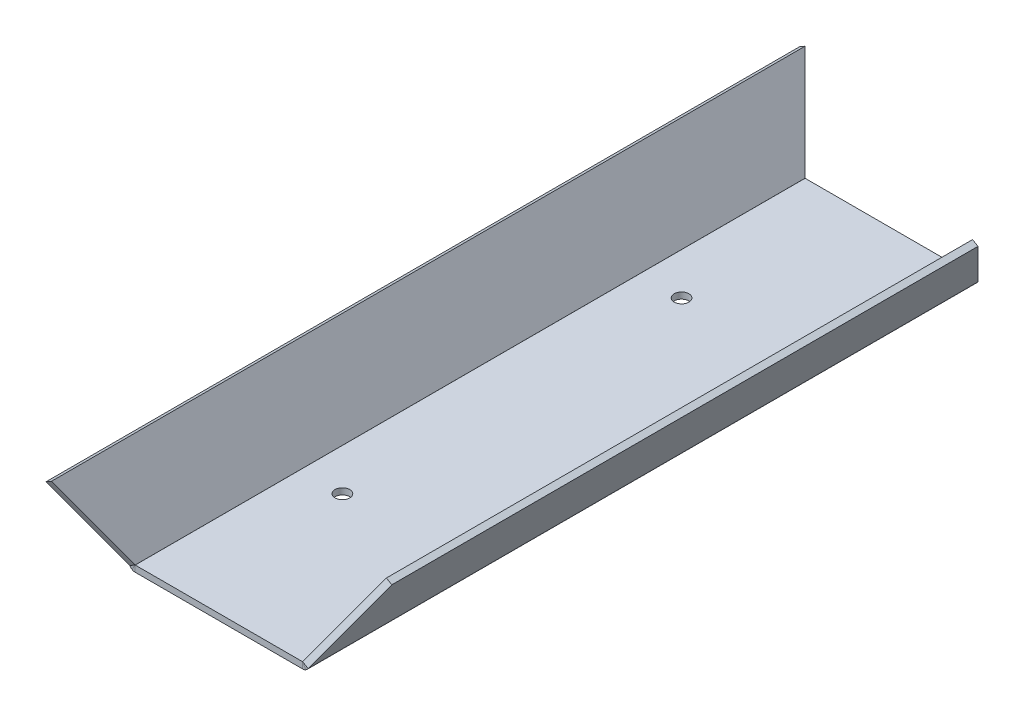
ISO-10303-21;
HEADER;
FILE_DESCRIPTION(('STEP AP214'),'2;1');
FILE_NAME('part.step','',(''),(''),'','','');
FILE_SCHEMA(('AUTOMOTIVE_DESIGN { 1 0 10303 214 1 1 1 1 }'));
ENDSEC;
DATA;
#1=APPLICATION_CONTEXT('core data for automotive mechanical design processes');
#2=APPLICATION_PROTOCOL_DEFINITION('international standard','automotive_design',2000,#1);
#3=PRODUCT_CONTEXT('',#1,'mechanical');
#4=PRODUCT('Part','Part','',(#3));
#5=PRODUCT_RELATED_PRODUCT_CATEGORY('part','',(#4));
#6=PRODUCT_DEFINITION_FORMATION('','',#4);
#7=PRODUCT_DEFINITION_CONTEXT('part definition',#1,'design');
#8=PRODUCT_DEFINITION('design','',#6,#7);
#9=PRODUCT_DEFINITION_SHAPE('','',#8);
#10=(LENGTH_UNIT() NAMED_UNIT(*) SI_UNIT(.MILLI.,.METRE.));
#11=(NAMED_UNIT(*) PLANE_ANGLE_UNIT() SI_UNIT($,.RADIAN.));
#12=(NAMED_UNIT(*) SI_UNIT($,.STERADIAN.) SOLID_ANGLE_UNIT());
#13=UNCERTAINTY_MEASURE_WITH_UNIT(LENGTH_MEASURE(1.E-05),#10,'distance_accuracy_value','');
#14=(GEOMETRIC_REPRESENTATION_CONTEXT(3) GLOBAL_UNCERTAINTY_ASSIGNED_CONTEXT((#13)) GLOBAL_UNIT_ASSIGNED_CONTEXT((#10,
#11,#12)) REPRESENTATION_CONTEXT('',''));
#15=CARTESIAN_POINT('',(0.,0.,0.));
#16=DIRECTION('',(0.,0.,1.));
#17=DIRECTION('',(1.,0.,0.));
#18=AXIS2_PLACEMENT_3D('',#15,#16,#17);
#19=CARTESIAN_POINT('',(20.,1.5,80.));
#20=DIRECTION('',(0.,0.,-1.));
#21=DIRECTION('',(-1.,0.,0.));
#22=AXIS2_PLACEMENT_3D('',#19,#20,#21);
#23=PLANE('',#22);
#24=DIRECTION('',(1.,0.,0.));
#25=VECTOR('',#24,1.);
#26=CARTESIAN_POINT('',(20.,1.5,80.));
#27=LINE('',#26,#25);
#28=CARTESIAN_POINT('',(20.0052438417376,1.5,80.));
#29=VERTEX_POINT('',#28);
#30=CARTESIAN_POINT('',(59.9947561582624,1.5,80.));
#31=VERTEX_POINT('',#30);
#32=EDGE_CURVE('E586',#29,#31,#27,.T.);
#33=ORIENTED_EDGE('',*,*,#32,.F.);
#34=DIRECTION('',(0.,-1.,0.));
#35=VECTOR('',#34,1.);
#36=CARTESIAN_POINT('',(20.0052438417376,1.5,80.));
#37=LINE('',#36,#35);
#38=CARTESIAN_POINT('',(20.0052438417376,0.,80.));
#39=VERTEX_POINT('',#38);
#40=EDGE_CURVE('E12',#29,#39,#37,.T.);
#41=ORIENTED_EDGE('',*,*,#40,.T.);
#42=DIRECTION('',(1.,0.,0.));
#43=VECTOR('',#42,1.);
#44=CARTESIAN_POINT('',(20.,0.,80.));
#45=LINE('',#44,#43);
#46=CARTESIAN_POINT('',(59.9947561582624,0.,80.));
#47=VERTEX_POINT('',#46);
#48=EDGE_CURVE('E481',#39,#47,#45,.T.);
#49=ORIENTED_EDGE('',*,*,#48,.T.);
#50=DIRECTION('',(0.,-1.,0.));
#51=VECTOR('',#50,1.);
#52=CARTESIAN_POINT('',(59.9947561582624,1.5,80.));
#53=LINE('',#52,#51);
#54=EDGE_CURVE('E499',#31,#47,#53,.T.);
#55=ORIENTED_EDGE('',*,*,#54,.F.);
#56=EDGE_LOOP('',(#33,#41,#49,#55));
#57=FACE_BOUND('',#56,.T.);
#58=ADVANCED_FACE('F66',(#57),#23,.F.);
#59=CARTESIAN_POINT('',(20.,1.5,-80.));
#60=DIRECTION('',(0.,0.,1.));
#61=DIRECTION('',(1.,0.,0.));
#62=AXIS2_PLACEMENT_3D('',#59,#60,#61);
#63=PLANE('',#62);
#64=DIRECTION('',(-1.,0.,0.));
#65=VECTOR('',#64,1.);
#66=CARTESIAN_POINT('',(20.,0.,-80.));
#67=LINE('',#66,#65);
#68=CARTESIAN_POINT('',(59.9947561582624,0.,-80.));
#69=VERTEX_POINT('',#68);
#70=CARTESIAN_POINT('',(20.0052438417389,0.,-80.));
#71=VERTEX_POINT('',#70);
#72=EDGE_CURVE('E488',#69,#71,#67,.T.);
#73=ORIENTED_EDGE('',*,*,#72,.T.);
#74=DIRECTION('',(0.,1.,0.));
#75=VECTOR('',#74,1.);
#76=CARTESIAN_POINT('',(20.0052438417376,1.5,-80.));
#77=LINE('',#76,#75);
#78=CARTESIAN_POINT('',(20.0052438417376,1.5,-80.));
#79=VERTEX_POINT('',#78);
#80=EDGE_CURVE('E578',#71,#79,#77,.T.);
#81=ORIENTED_EDGE('',*,*,#80,.T.);
#82=DIRECTION('',(-1.,0.,0.));
#83=VECTOR('',#82,1.);
#84=CARTESIAN_POINT('',(20.,1.5,-80.));
#85=LINE('',#84,#83);
#86=CARTESIAN_POINT('',(59.9947561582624,1.5,-80.));
#87=VERTEX_POINT('',#86);
#88=EDGE_CURVE('E492',#87,#79,#85,.T.);
#89=ORIENTED_EDGE('',*,*,#88,.F.);
#90=DIRECTION('',(0.,1.,0.));
#91=VECTOR('',#90,1.);
#92=CARTESIAN_POINT('',(59.9947561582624,1.5,-80.));
#93=LINE('',#92,#91);
#94=EDGE_CURVE('E496',#69,#87,#93,.T.);
#95=ORIENTED_EDGE('',*,*,#94,.F.);
#96=EDGE_LOOP('',(#73,#81,#89,#95));
#97=FACE_BOUND('',#96,.T.);
#98=ADVANCED_FACE('F561',(#97),#63,.F.);
#99=CARTESIAN_POINT('',(80.,1.5,-50.));
#100=DIRECTION('',(0.,-1.,0.));
#101=DIRECTION('',(0.,0.,-1.));
#102=AXIS2_PLACEMENT_3D('',#99,#100,#101);
#103=PLANE('',#102);
#104=CARTESIAN_POINT('',(30.,1.5,40.5));
#105=DIRECTION('',(0.,1.,0.));
#106=DIRECTION('',(0.,0.,-1.));
#107=AXIS2_PLACEMENT_3D('',#104,#105,#106);
#108=CIRCLE('',#107,1.75);
#109=CARTESIAN_POINT('',(30.,1.5,38.75));
#110=VERTEX_POINT('',#109);
#111=EDGE_CURVE('E493',#110,#110,#108,.T.);
#112=ORIENTED_EDGE('',*,*,#111,.F.);
#113=EDGE_LOOP('',(#112));
#114=FACE_BOUND('',#113,.T.);
#115=CARTESIAN_POINT('',(30.,1.5,-40.5));
#116=DIRECTION('',(0.,1.,0.));
#117=DIRECTION('',(0.,0.,1.));
#118=AXIS2_PLACEMENT_3D('',#115,#116,#117);
#119=CIRCLE('',#118,1.75);
#120=CARTESIAN_POINT('',(30.,1.5,-38.75));
#121=VERTEX_POINT('',#120);
#122=EDGE_CURVE('E489',#121,#121,#119,.T.);
#123=ORIENTED_EDGE('',*,*,#122,.F.);
#124=EDGE_LOOP('',(#123));
#125=FACE_BOUND('',#124,.T.);
#126=ORIENTED_EDGE('',*,*,#88,.T.);
#127=DIRECTION('',(0.,0.,1.));
#128=VECTOR('',#127,1.);
#129=CARTESIAN_POINT('',(20.0052438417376,1.5,-50.));
#130=LINE('',#129,#128);
#131=EDGE_CURVE('E570',#79,#29,#130,.T.);
#132=ORIENTED_EDGE('',*,*,#131,.T.);
#133=ORIENTED_EDGE('',*,*,#32,.T.);
#134=DIRECTION('',(0.,0.,1.));
#135=VECTOR('',#134,1.);
#136=CARTESIAN_POINT('',(59.9947561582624,1.5,-50.));
#137=LINE('',#136,#135);
#138=EDGE_CURVE('E502',#87,#31,#137,.T.);
#139=ORIENTED_EDGE('',*,*,#138,.F.);
#140=EDGE_LOOP('',(#126,#132,#133,#139));
#141=FACE_BOUND('',#140,.T.);
#142=ADVANCED_FACE('F549',(#114,#125,#141),#103,.F.);
#143=CARTESIAN_POINT('',(60.0007944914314,1.5004586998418,-80.));
#144=DIRECTION('',(-0.223606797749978,-0.387298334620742,0.894427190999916));
#145=DIRECTION('',(0.447213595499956,0.774596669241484,0.447213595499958));
#146=AXIS2_PLACEMENT_3D('',#143,#144,#145);
#147=PLANE('',#146);
#148=DIRECTION('',(-0.447213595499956,-0.774596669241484,-0.447213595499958));
#149=VECTOR('',#148,1.);
#150=CARTESIAN_POINT('',(61.2998325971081,0.750458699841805,-80.));
#151=LINE('',#150,#149);
#152=CARTESIAN_POINT('',(71.2998325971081,18.0709667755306,-70.));
#153=VERTEX_POINT('',#152);
#154=CARTESIAN_POINT('',(61.302454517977,0.75500000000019,-79.9973780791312));
#155=VERTEX_POINT('',#154);
#156=EDGE_CURVE('E511',#153,#155,#151,.T.);
#157=ORIENTED_EDGE('',*,*,#156,.T.);
#158=CARTESIAN_POINT('',(60.0034164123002,1.50499999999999,-79.9973780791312));
#159=CARTESIAN_POINT('',(61.3024545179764,0.754999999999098,-79.9973780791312));
#160=B_SPLINE_CURVE_WITH_KNOTS('',1,(#158,#159),.UNSPECIFIED.,.F.,.F.,(2,2),(0.,1.),.UNSPECIFIED.);
#161=CARTESIAN_POINT('',(60.0034164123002,1.505,-79.9973780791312));
#162=VERTEX_POINT('',#161);
#163=EDGE_CURVE('E469',#155,#162,#160,.F.);
#164=ORIENTED_EDGE('',*,*,#163,.T.);
#165=DIRECTION('',(-0.447213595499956,-0.774596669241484,-0.447213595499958));
#166=VECTOR('',#165,1.);
#167=CARTESIAN_POINT('',(60.0007944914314,1.5004586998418,-80.));
#168=LINE('',#167,#166);
#169=CARTESIAN_POINT('',(70.0007944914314,18.8209667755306,-70.));
#170=VERTEX_POINT('',#169);
#171=EDGE_CURVE('E507',#170,#162,#168,.T.);
#172=ORIENTED_EDGE('',*,*,#171,.F.);
#173=DIRECTION('',(0.86602540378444,-0.499999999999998,0.));
#174=VECTOR('',#173,1.);
#175=CARTESIAN_POINT('',(70.0007944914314,18.8209667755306,-70.));
#176=LINE('',#175,#174);
#177=EDGE_CURVE('E513',#170,#153,#176,.T.);
#178=ORIENTED_EDGE('',*,*,#177,.T.);
#179=EDGE_LOOP('',(#157,#164,#172,#178));
#180=FACE_BOUND('',#179,.T.);
#181=ADVANCED_FACE('F538',(#180),#147,.F.);
#182=CARTESIAN_POINT('',(60.0007944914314,1.50045869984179,80.));
#183=DIRECTION('',(-0.223606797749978,-0.387298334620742,-0.894427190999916));
#184=DIRECTION('',(-0.447213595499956,-0.774596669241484,0.447213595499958));
#185=AXIS2_PLACEMENT_3D('',#182,#183,#184);
#186=PLANE('',#185);
#187=DIRECTION('',(0.447213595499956,0.774596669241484,-0.447213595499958));
#188=VECTOR('',#187,1.);
#189=CARTESIAN_POINT('',(60.0007944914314,1.50045869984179,80.));
#190=LINE('',#189,#188);
#191=CARTESIAN_POINT('',(60.0034164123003,1.50500000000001,79.9973780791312));
#192=VERTEX_POINT('',#191);
#193=CARTESIAN_POINT('',(70.0007944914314,18.8209667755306,70.));
#194=VERTEX_POINT('',#193);
#195=EDGE_CURVE('E508',#192,#194,#190,.T.);
#196=ORIENTED_EDGE('',*,*,#195,.F.);
#197=CARTESIAN_POINT('',(61.3024545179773,0.755000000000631,79.9973780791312));
#198=CARTESIAN_POINT('',(60.0034164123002,1.505,79.9973780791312));
#199=B_SPLINE_CURVE_WITH_KNOTS('',1,(#197,#198),.UNSPECIFIED.,.F.,.F.,(2,2),(0.,1.),.UNSPECIFIED.);
#200=CARTESIAN_POINT('',(61.3024545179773,0.755000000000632,79.9973780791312));
#201=VERTEX_POINT('',#200);
#202=EDGE_CURVE('E579',#192,#201,#199,.F.);
#203=ORIENTED_EDGE('',*,*,#202,.T.);
#204=DIRECTION('',(0.447213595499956,0.774596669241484,-0.447213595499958));
#205=VECTOR('',#204,1.);
#206=CARTESIAN_POINT('',(61.2998325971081,0.750458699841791,80.));
#207=LINE('',#206,#205);
#208=CARTESIAN_POINT('',(71.2998325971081,18.0709667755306,70.));
#209=VERTEX_POINT('',#208);
#210=EDGE_CURVE('E512',#201,#209,#207,.T.);
#211=ORIENTED_EDGE('',*,*,#210,.T.);
#212=DIRECTION('',(0.86602540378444,-0.499999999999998,0.));
#213=VECTOR('',#212,1.);
#214=CARTESIAN_POINT('',(70.0007944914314,18.8209667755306,70.));
#215=LINE('',#214,#213);
#216=EDGE_CURVE('E516',#194,#209,#215,.T.);
#217=ORIENTED_EDGE('',*,*,#216,.F.);
#218=EDGE_LOOP('',(#196,#203,#211,#217));
#219=FACE_BOUND('',#218,.T.);
#220=ADVANCED_FACE('F548',(#219),#186,.F.);
#221=CARTESIAN_POINT('',(70.0007944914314,18.8209667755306,-50.));
#222=DIRECTION('',(0.86602540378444,-0.499999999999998,0.));
#223=DIRECTION('',(0.,0.,-1.));
#224=AXIS2_PLACEMENT_3D('',#221,#222,#223);
#225=PLANE('',#224);
#226=ORIENTED_EDGE('',*,*,#171,.T.);
#227=DIRECTION('',(0.,0.,1.));
#228=VECTOR('',#227,1.);
#229=CARTESIAN_POINT('',(60.0034164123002,1.50500000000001,-50.));
#230=LINE('',#229,#228);
#231=EDGE_CURVE('E519',#162,#192,#230,.T.);
#232=ORIENTED_EDGE('',*,*,#231,.T.);
#233=ORIENTED_EDGE('',*,*,#195,.T.);
#234=DIRECTION('',(0.,0.,-1.));
#235=VECTOR('',#234,1.);
#236=CARTESIAN_POINT('',(70.0007944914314,18.8209667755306,-70.));
#237=LINE('',#236,#235);
#238=EDGE_CURVE('E505',#194,#170,#237,.T.);
#239=ORIENTED_EDGE('',*,*,#238,.T.);
#240=EDGE_LOOP('',(#226,#232,#233,#239));
#241=FACE_BOUND('',#240,.T.);
#242=ADVANCED_FACE('F550',(#241),#225,.F.);
#243=CARTESIAN_POINT('',(71.2998325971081,18.0709667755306,-50.));
#244=DIRECTION('',(0.86602540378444,-0.499999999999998,0.));
#245=DIRECTION('',(0.,0.,-1.));
#246=AXIS2_PLACEMENT_3D('',#243,#244,#245);
#247=PLANE('',#246);
#248=DIRECTION('',(0.,0.,1.));
#249=VECTOR('',#248,1.);
#250=CARTESIAN_POINT('',(61.3024545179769,0.755000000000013,-50.));
#251=LINE('',#250,#249);
#252=EDGE_CURVE('E730',#155,#201,#251,.T.);
#253=ORIENTED_EDGE('',*,*,#252,.F.);
#254=ORIENTED_EDGE('',*,*,#156,.F.);
#255=DIRECTION('',(0.,0.,-1.));
#256=VECTOR('',#255,1.);
#257=CARTESIAN_POINT('',(71.2998325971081,18.0709667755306,-70.));
#258=LINE('',#257,#256);
#259=EDGE_CURVE('E509',#209,#153,#258,.T.);
#260=ORIENTED_EDGE('',*,*,#259,.F.);
#261=ORIENTED_EDGE('',*,*,#210,.F.);
#262=EDGE_LOOP('',(#253,#254,#260,#261));
#263=FACE_BOUND('',#262,.T.);
#264=ADVANCED_FACE('F552',(#263),#247,.T.);
#265=CARTESIAN_POINT('',(70.0007944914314,18.8209667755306,-70.));
#266=DIRECTION('',(-0.499999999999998,-0.86602540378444,0.));
#267=DIRECTION('',(0.,0.,1.));
#268=AXIS2_PLACEMENT_3D('',#265,#266,#267);
#269=PLANE('',#268);
#270=ORIENTED_EDGE('',*,*,#259,.T.);
#271=ORIENTED_EDGE('',*,*,#177,.F.);
#272=ORIENTED_EDGE('',*,*,#238,.F.);
#273=ORIENTED_EDGE('',*,*,#216,.T.);
#274=EDGE_LOOP('',(#270,#271,#272,#273));
#275=FACE_BOUND('',#274,.T.);
#276=ADVANCED_FACE('F555',(#275),#269,.F.);
#277=CARTESIAN_POINT('',(30.,1.5,40.5));
#278=DIRECTION('',(0.,-1.,0.));
#279=DIRECTION('',(0.,0.,-1.));
#280=AXIS2_PLACEMENT_3D('',#277,#278,#279);
#281=CYLINDRICAL_SURFACE('',#280,1.75);
#282=ORIENTED_EDGE('',*,*,#111,.T.);
#283=EDGE_LOOP('',(#282));
#284=FACE_BOUND('',#283,.T.);
#285=CARTESIAN_POINT('',(30.,0.,40.5));
#286=DIRECTION('',(0.,1.,0.));
#287=DIRECTION('',(0.,0.,-1.));
#288=AXIS2_PLACEMENT_3D('',#285,#286,#287);
#289=CIRCLE('',#288,1.75);
#290=CARTESIAN_POINT('',(30.,0.,38.75));
#291=VERTEX_POINT('',#290);
#292=EDGE_CURVE('E482',#291,#291,#289,.T.);
#293=ORIENTED_EDGE('',*,*,#292,.F.);
#294=EDGE_LOOP('',(#293));
#295=FACE_BOUND('',#294,.T.);
#296=ADVANCED_FACE('F430',(#284,#295),#281,.F.);
#297=CARTESIAN_POINT('',(30.,1.5,-40.5));
#298=DIRECTION('',(0.,-1.,0.));
#299=DIRECTION('',(0.,0.,-1.));
#300=AXIS2_PLACEMENT_3D('',#297,#298,#299);
#301=CYLINDRICAL_SURFACE('',#300,1.75);
#302=ORIENTED_EDGE('',*,*,#122,.T.);
#303=EDGE_LOOP('',(#302));
#304=FACE_BOUND('',#303,.T.);
#305=CARTESIAN_POINT('',(30.,0.,-40.5));
#306=DIRECTION('',(0.,1.,0.));
#307=DIRECTION('',(0.,0.,1.));
#308=AXIS2_PLACEMENT_3D('',#305,#306,#307);
#309=CIRCLE('',#308,1.75);
#310=CARTESIAN_POINT('',(30.,0.,-38.75));
#311=VERTEX_POINT('',#310);
#312=EDGE_CURVE('E485',#311,#311,#309,.T.);
#313=ORIENTED_EDGE('',*,*,#312,.F.);
#314=EDGE_LOOP('',(#313));
#315=FACE_BOUND('',#314,.T.);
#316=ADVANCED_FACE('F761',(#304,#315),#301,.F.);
#317=CARTESIAN_POINT('',(80.,0.,-50.));
#318=DIRECTION('',(0.,-1.,0.));
#319=DIRECTION('',(0.,0.,-1.));
#320=AXIS2_PLACEMENT_3D('',#317,#318,#319);
#321=PLANE('',#320);
#322=DIRECTION('',(0.,0.,1.));
#323=VECTOR('',#322,1.);
#324=CARTESIAN_POINT('',(20.0052438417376,0.,-50.));
#325=LINE('',#324,#323);
#326=EDGE_CURVE('E77',#71,#39,#325,.T.);
#327=ORIENTED_EDGE('',*,*,#326,.F.);
#328=ORIENTED_EDGE('',*,*,#72,.F.);
#329=DIRECTION('',(0.,0.,1.));
#330=VECTOR('',#329,1.);
#331=CARTESIAN_POINT('',(59.9947561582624,0.,-50.));
#332=LINE('',#331,#330);
#333=EDGE_CURVE('E473',#69,#47,#332,.T.);
#334=ORIENTED_EDGE('',*,*,#333,.T.);
#335=ORIENTED_EDGE('',*,*,#48,.F.);
#336=EDGE_LOOP('',(#327,#328,#334,#335));
#337=FACE_BOUND('',#336,.T.);
#338=ORIENTED_EDGE('',*,*,#312,.T.);
#339=EDGE_LOOP('',(#338));
#340=FACE_BOUND('',#339,.T.);
#341=ORIENTED_EDGE('',*,*,#292,.T.);
#342=EDGE_LOOP('',(#341));
#343=FACE_BOUND('',#342,.T.);
#344=ADVANCED_FACE('F68',(#337,#340,#343),#321,.T.);
#345=CARTESIAN_POINT('',(59.9947561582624,1.51,-80.));
#346=DIRECTION('',(0.,0.,1.));
#347=DIRECTION('',(1.,0.,0.));
#348=AXIS2_PLACEMENT_3D('',#345,#346,#347);
#349=PLANE('',#348);
#350=CARTESIAN_POINT('',(60.7497561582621,0.202301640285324,-80.));
#351=CARTESIAN_POINT('',(59.9997561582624,1.50133974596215,-80.));
#352=B_SPLINE_CURVE_WITH_KNOTS('',1,(#350,#351),.UNSPECIFIED.,.F.,.F.,(2,2),(0.,1.),.UNSPECIFIED.);
#353=CARTESIAN_POINT('',(60.7497561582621,0.202301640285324,-80.));
#354=VERTEX_POINT('',#353);
#355=CARTESIAN_POINT('',(59.9997561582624,1.50133974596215,-80.));
#356=VERTEX_POINT('',#355);
#357=EDGE_CURVE('E459',#354,#356,#352,.T.);
#358=ORIENTED_EDGE('',*,*,#357,.F.);
#359=CARTESIAN_POINT('',(59.9947561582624,1.51,-80.));
#360=DIRECTION('',(0.,0.,-1.));
#361=DIRECTION('',(-1.,0.,0.));
#362=AXIS2_PLACEMENT_3D('',#359,#360,#361);
#363=CIRCLE('',#362,1.51);
#364=EDGE_CURVE('E670',#354,#69,#363,.T.);
#365=ORIENTED_EDGE('',*,*,#364,.T.);
#366=ORIENTED_EDGE('',*,*,#94,.T.);
#367=CARTESIAN_POINT('',(59.9947561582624,1.51,-80.));
#368=DIRECTION('',(0.,0.,-1.));
#369=DIRECTION('',(-1.,0.,0.));
#370=AXIS2_PLACEMENT_3D('',#367,#368,#369);
#371=CIRCLE('',#370,0.0100000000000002);
#372=EDGE_CURVE('E665',#356,#87,#371,.T.);
#373=ORIENTED_EDGE('',*,*,#372,.F.);
#374=EDGE_LOOP('',(#358,#365,#366,#373));
#375=FACE_BOUND('',#374,.T.);
#376=ADVANCED_FACE('F427',(#375),#349,.F.);
#377=CARTESIAN_POINT('',(59.9947561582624,1.51,80.));
#378=DIRECTION('',(0.,1.38777878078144E-12,-1.));
#379=DIRECTION('',(0.,1.,1.38777878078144E-12));
#380=AXIS2_PLACEMENT_3D('',#377,#378,#379);
#381=PLANE('',#380);
#382=ORIENTED_EDGE('',*,*,#54,.T.);
#383=CARTESIAN_POINT('',(59.9947561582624,1.51,80.));
#384=DIRECTION('',(0.,0.,-1.));
#385=DIRECTION('',(-1.,0.,0.));
#386=AXIS2_PLACEMENT_3D('',#383,#384,#385);
#387=CIRCLE('',#386,1.51);
#388=CARTESIAN_POINT('',(60.74975615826,0.202301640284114,80.));
#389=VERTEX_POINT('',#388);
#390=EDGE_CURVE('E672',#47,#389,#387,.F.);
#391=ORIENTED_EDGE('',*,*,#390,.T.);
#392=CARTESIAN_POINT('',(59.9997561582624,1.50133974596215,80.));
#393=CARTESIAN_POINT('',(60.74975615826,0.202301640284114,80.));
#394=B_SPLINE_CURVE_WITH_KNOTS('',1,(#392,#393),.UNSPECIFIED.,.F.,.F.,(2,2),(0.,1.),.UNSPECIFIED.);
#395=CARTESIAN_POINT('',(59.9997561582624,1.50133974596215,80.));
#396=VERTEX_POINT('',#395);
#397=EDGE_CURVE('E660',#389,#396,#394,.F.);
#398=ORIENTED_EDGE('',*,*,#397,.T.);
#399=CARTESIAN_POINT('',(59.9947561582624,1.51,80.));
#400=DIRECTION('',(0.,-1.38777878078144E-12,1.));
#401=DIRECTION('',(0.,-1.,-1.38777878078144E-12));
#402=AXIS2_PLACEMENT_3D('',#399,#400,#401);
#403=CIRCLE('',#402,0.0100000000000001);
#404=EDGE_CURVE('E658',#31,#396,#403,.T.);
#405=ORIENTED_EDGE('',*,*,#404,.F.);
#406=EDGE_LOOP('',(#382,#391,#398,#405));
#407=FACE_BOUND('',#406,.T.);
#408=ADVANCED_FACE('F687',(#407),#381,.F.);
#409=CARTESIAN_POINT('',(60.74975615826,0.202301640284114,80.));
#410=CARTESIAN_POINT('',(60.9783620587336,0.334287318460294,79.9991289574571));
#411=CARTESIAN_POINT('',(61.1704688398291,0.526394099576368,79.998257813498));
#412=CARTESIAN_POINT('',(61.3024545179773,0.755000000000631,79.9973780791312));
#413=CARTESIAN_POINT('',(59.9997561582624,1.50133974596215,80.));
#414=CARTESIAN_POINT('',(60.0012697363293,1.50221361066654,79.9991291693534));
#415=CARTESIAN_POINT('',(60.0025425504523,1.50348642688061,79.9982575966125));
#416=CARTESIAN_POINT('',(60.0034164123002,1.505,79.9973780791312));
#417=B_SPLINE_SURFACE_WITH_KNOTS('',1,3,((#409,#410,#411,#412),(#413,#414,#415,#416)),
.UNSPECIFIED.,.F.,.F.,.F.,(2,2),(4,4),(0.,1.),(0.,1.),.UNSPECIFIED.);
#418=CARTESIAN_POINT('',(60.74975615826,0.202301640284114,80.));
#419=CARTESIAN_POINT('',(60.9783620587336,0.334287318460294,79.9991289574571));
#420=CARTESIAN_POINT('',(61.1704688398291,0.526394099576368,79.998257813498));
#421=CARTESIAN_POINT('',(61.3024545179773,0.755000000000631,79.9973780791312));
#422=B_SPLINE_CURVE_WITH_KNOTS('',3,(#418,#419,#420,#421),.UNSPECIFIED.,.F.,.F.,(4,4),(0.,1.),.UNSPECIFIED.);
#423=EDGE_CURVE('E666',#389,#201,#422,.T.);
#424=CARTESIAN_POINT('',(60.0034164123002,1.505,79.9973780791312));
#425=CARTESIAN_POINT('',(60.0025425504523,1.50348642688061,79.9982575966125));
#426=CARTESIAN_POINT('',(60.0012697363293,1.50221361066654,79.9991291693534));
#427=CARTESIAN_POINT('',(59.9997561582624,1.50133974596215,80.));
#428=B_SPLINE_CURVE_WITH_KNOTS('',3,(#424,#425,#426,#427),.UNSPECIFIED.,.F.,.F.,(4,4),(0.,1.),.UNSPECIFIED.);
#429=EDGE_CURVE('E93',#396,#192,#428,.F.);
#430=ORIENTED_EDGE('',*,*,#397,.F.);
#431=ORIENTED_EDGE('',*,*,#423,.T.);
#432=ORIENTED_EDGE('',*,*,#202,.F.);
#433=ORIENTED_EDGE('',*,*,#429,.F.);
#434=EDGE_LOOP('',(#430,#431,#432,#433));
#435=FACE_BOUND('',#434,.T.);
#436=ADVANCED_FACE('F372',(#435),#417,.F.);
#437=CARTESIAN_POINT('',(61.3024545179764,0.754999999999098,-79.9973780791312));
#438=CARTESIAN_POINT('',(61.1704688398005,0.526394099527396,-79.998249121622));
#439=CARTESIAN_POINT('',(60.978362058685,0.334287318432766,-79.9991202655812));
#440=CARTESIAN_POINT('',(60.7497561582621,0.202301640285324,-80.));
#441=CARTESIAN_POINT('',(60.0034164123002,1.50499999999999,-79.9973780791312));
#442=CARTESIAN_POINT('',(60.0025425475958,1.50348642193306,-79.9982489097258));
#443=CARTESIAN_POINT('',(60.0012697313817,1.50221360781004,-79.9991204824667));
#444=CARTESIAN_POINT('',(59.9997561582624,1.50133974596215,-80.));
#445=B_SPLINE_SURFACE_WITH_KNOTS('',1,3,((#437,#438,#439,#440),(#441,#442,#443,#444)),
.UNSPECIFIED.,.F.,.F.,.F.,(2,2),(4,4),(0.,1.),(0.,1.),.UNSPECIFIED.);
#446=CARTESIAN_POINT('',(61.3024545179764,0.754999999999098,-79.9973780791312));
#447=CARTESIAN_POINT('',(61.1704688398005,0.526394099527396,-79.998249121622));
#448=CARTESIAN_POINT('',(60.978362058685,0.334287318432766,-79.9991202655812));
#449=CARTESIAN_POINT('',(60.7497561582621,0.202301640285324,-80.));
#450=B_SPLINE_CURVE_WITH_KNOTS('',3,(#446,#447,#448,#449),.UNSPECIFIED.,.F.,.F.,(4,4),(0.,1.),.UNSPECIFIED.);
#451=EDGE_CURVE('E398',#155,#354,#450,.T.);
#452=CARTESIAN_POINT('',(59.9997561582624,1.50133974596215,-80.));
#453=CARTESIAN_POINT('',(60.0012697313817,1.50221360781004,-79.9991204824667));
#454=CARTESIAN_POINT('',(60.0025425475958,1.50348642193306,-79.9982489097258));
#455=CARTESIAN_POINT('',(60.0034164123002,1.50499999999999,-79.9973780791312));
#456=B_SPLINE_CURVE_WITH_KNOTS('',3,(#452,#453,#454,#455),.UNSPECIFIED.,.F.,.F.,(4,4),(0.,1.),.UNSPECIFIED.);
#457=EDGE_CURVE('E392',#162,#356,#456,.F.);
#458=ORIENTED_EDGE('',*,*,#451,.T.);
#459=ORIENTED_EDGE('',*,*,#357,.T.);
#460=ORIENTED_EDGE('',*,*,#457,.F.);
#461=ORIENTED_EDGE('',*,*,#163,.F.);
#462=EDGE_LOOP('',(#458,#459,#460,#461));
#463=FACE_BOUND('',#462,.T.);
#464=ADVANCED_FACE('F371',(#463),#445,.F.);
#465=CARTESIAN_POINT('',(59.9947561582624,1.51,160.00703143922));
#466=DIRECTION('',(0.,0.,-1.));
#467=DIRECTION('',(-1.,0.,0.));
#468=AXIS2_PLACEMENT_3D('',#465,#466,#467);
#469=CYLINDRICAL_SURFACE('',#468,0.01);
#470=ORIENTED_EDGE('',*,*,#231,.F.);
#471=ORIENTED_EDGE('',*,*,#457,.T.);
#472=ORIENTED_EDGE('',*,*,#372,.T.);
#473=ORIENTED_EDGE('',*,*,#138,.T.);
#474=ORIENTED_EDGE('',*,*,#404,.T.);
#475=ORIENTED_EDGE('',*,*,#429,.T.);
#476=EDGE_LOOP('',(#470,#471,#472,#473,#474,#475));
#477=FACE_BOUND('',#476,.T.);
#478=ADVANCED_FACE('F362',(#477),#469,.F.);
#479=CARTESIAN_POINT('',(59.9947561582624,1.51,160.00703143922));
#480=DIRECTION('',(0.,0.,-1.));
#481=DIRECTION('',(-1.,0.,0.));
#482=AXIS2_PLACEMENT_3D('',#479,#480,#481);
#483=CYLINDRICAL_SURFACE('',#482,1.51);
#484=ORIENTED_EDGE('',*,*,#252,.T.);
#485=ORIENTED_EDGE('',*,*,#423,.F.);
#486=ORIENTED_EDGE('',*,*,#390,.F.);
#487=ORIENTED_EDGE('',*,*,#333,.F.);
#488=ORIENTED_EDGE('',*,*,#364,.F.);
#489=ORIENTED_EDGE('',*,*,#451,.F.);
#490=EDGE_LOOP('',(#484,#485,#486,#487,#488,#489));
#491=FACE_BOUND('',#490,.T.);
#492=ADVANCED_FACE('F310',(#491),#483,.T.);
#493=CARTESIAN_POINT('',(19.2502438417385,0.202301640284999,-80.));
#494=CARTESIAN_POINT('',(19.0216379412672,0.334287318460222,-80.0008710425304));
#495=CARTESIAN_POINT('',(18.8295311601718,0.526394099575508,-80.0017421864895));
#496=CARTESIAN_POINT('',(18.6975454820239,0.75499999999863,-80.0026219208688));
#497=CARTESIAN_POINT('',(20.0002438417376,1.50133974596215,-80.));
#498=CARTESIAN_POINT('',(19.9987302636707,1.50221361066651,-80.0008708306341));
#499=CARTESIAN_POINT('',(19.9974574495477,1.50348642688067,-80.001742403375));
#500=CARTESIAN_POINT('',(19.9965835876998,1.50499999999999,-80.0026219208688));
#501=B_SPLINE_SURFACE_WITH_KNOTS('',1,3,((#493,#494,#495,#496),(#497,#498,#499,#500)),
.UNSPECIFIED.,.F.,.F.,.F.,(2,2),(4,4),(0.,1.),(0.,1.),.UNSPECIFIED.);
#502=CARTESIAN_POINT('',(20.0002438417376,1.50133974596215,-80.));
#503=CARTESIAN_POINT('',(19.2502438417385,0.202301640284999,-80.));
#504=B_SPLINE_CURVE_WITH_KNOTS('',1,(#502,#503),.UNSPECIFIED.,.F.,.F.,(2,2),(0.,1.),.UNSPECIFIED.);
#505=CARTESIAN_POINT('',(19.2502438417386,0.202301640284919,-80.));
#506=VERTEX_POINT('',#505);
#507=CARTESIAN_POINT('',(20.0002438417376,1.50133974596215,-80.));
#508=VERTEX_POINT('',#507);
#509=EDGE_CURVE('E342',#506,#508,#504,.F.);
#510=CARTESIAN_POINT('',(19.2502438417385,0.202301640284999,-80.));
#511=CARTESIAN_POINT('',(19.0216379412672,0.334287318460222,-80.0008710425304));
#512=CARTESIAN_POINT('',(18.8295311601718,0.526394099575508,-80.0017421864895));
#513=CARTESIAN_POINT('',(18.6975454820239,0.75499999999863,-80.0026219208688));
#514=B_SPLINE_CURVE_WITH_KNOTS('',3,(#510,#511,#512,#513),.UNSPECIFIED.,.F.,.F.,(4,4),(0.,1.),.UNSPECIFIED.);
#515=CARTESIAN_POINT('',(18.6975454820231,0.754999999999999,-80.0026219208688));
#516=VERTEX_POINT('',#515);
#517=EDGE_CURVE('E278',#506,#516,#514,.T.);
#518=CARTESIAN_POINT('',(18.6975454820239,0.75499999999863,-80.0026219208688));
#519=CARTESIAN_POINT('',(19.9965835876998,1.50499999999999,-80.0026219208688));
#520=B_SPLINE_CURVE_WITH_KNOTS('',1,(#518,#519),.UNSPECIFIED.,.F.,.F.,(2,2),(0.,1.),.UNSPECIFIED.);
#521=CARTESIAN_POINT('',(19.9965835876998,1.505,-80.0026219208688));
#522=VERTEX_POINT('',#521);
#523=EDGE_CURVE('E192',#516,#522,#520,.T.);
#524=CARTESIAN_POINT('',(19.9965835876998,1.50499999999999,-80.0026219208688));
#525=CARTESIAN_POINT('',(19.9974574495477,1.50348642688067,-80.001742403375));
#526=CARTESIAN_POINT('',(19.9987302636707,1.50221361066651,-80.0008708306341));
#527=CARTESIAN_POINT('',(20.0002438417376,1.50133974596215,-80.));
#528=B_SPLINE_CURVE_WITH_KNOTS('',3,(#524,#525,#526,#527),.UNSPECIFIED.,.F.,.F.,(4,4),(0.,1.),.UNSPECIFIED.);
#529=EDGE_CURVE('E267',#508,#522,#528,.F.);
#530=ORIENTED_EDGE('',*,*,#509,.F.);
#531=ORIENTED_EDGE('',*,*,#517,.T.);
#532=ORIENTED_EDGE('',*,*,#523,.T.);
#533=ORIENTED_EDGE('',*,*,#529,.F.);
#534=EDGE_LOOP('',(#530,#531,#532,#533));
#535=FACE_BOUND('',#534,.T.);
#536=ADVANCED_FACE('F298',(#535),#501,.F.);
#537=CARTESIAN_POINT('',(18.6975454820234,0.75499999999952,80.0026219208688));
#538=CARTESIAN_POINT('',(18.8295311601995,0.526394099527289,80.0017508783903));
#539=CARTESIAN_POINT('',(19.0216379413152,0.334287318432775,80.0008797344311));
#540=CARTESIAN_POINT('',(19.2502438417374,0.202301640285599,80.));
#541=CARTESIAN_POINT('',(19.9965835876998,1.505,80.0026219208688));
#542=CARTESIAN_POINT('',(19.9974574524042,1.50348642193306,80.0017510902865));
#543=CARTESIAN_POINT('',(19.9987302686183,1.50221360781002,80.0008795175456));
#544=CARTESIAN_POINT('',(20.0002438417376,1.50133974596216,80.));
#545=B_SPLINE_SURFACE_WITH_KNOTS('',1,3,((#537,#538,#539,#540),(#541,#542,#543,#544)),
.UNSPECIFIED.,.F.,.F.,.F.,(2,2),(4,4),(0.,1.),(0.,1.),.UNSPECIFIED.);
#546=CARTESIAN_POINT('',(19.9965835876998,1.505,80.0026219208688));
#547=CARTESIAN_POINT('',(18.6975454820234,0.75499999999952,80.0026219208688));
#548=B_SPLINE_CURVE_WITH_KNOTS('',1,(#546,#547),.UNSPECIFIED.,.F.,.F.,(2,2),(0.,1.),.UNSPECIFIED.);
#549=CARTESIAN_POINT('',(19.9965835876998,1.505,80.0026219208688));
#550=VERTEX_POINT('',#549);
#551=CARTESIAN_POINT('',(18.6975454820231,0.754999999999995,80.0026219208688));
#552=VERTEX_POINT('',#551);
#553=EDGE_CURVE('E596',#550,#552,#548,.T.);
#554=CARTESIAN_POINT('',(18.6975454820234,0.75499999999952,80.0026219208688));
#555=CARTESIAN_POINT('',(18.8295311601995,0.526394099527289,80.0017508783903));
#556=CARTESIAN_POINT('',(19.0216379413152,0.334287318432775,80.0008797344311));
#557=CARTESIAN_POINT('',(19.2502438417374,0.202301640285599,80.));
#558=B_SPLINE_CURVE_WITH_KNOTS('',3,(#554,#555,#556,#557),.UNSPECIFIED.,.F.,.F.,(4,4),(0.,1.),.UNSPECIFIED.);
#559=CARTESIAN_POINT('',(19.2502438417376,0.202301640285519,80.));
#560=VERTEX_POINT('',#559);
#561=EDGE_CURVE('E219',#552,#560,#558,.T.);
#562=CARTESIAN_POINT('',(19.2502438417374,0.202301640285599,80.));
#563=CARTESIAN_POINT('',(20.0002438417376,1.50133974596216,80.));
#564=B_SPLINE_CURVE_WITH_KNOTS('',1,(#562,#563),.UNSPECIFIED.,.F.,.F.,(2,2),(0.,1.),.UNSPECIFIED.);
#565=CARTESIAN_POINT('',(20.0002438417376,1.50133974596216,80.));
#566=VERTEX_POINT('',#565);
#567=EDGE_CURVE('E270',#560,#566,#564,.T.);
#568=CARTESIAN_POINT('',(20.0002438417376,1.50133974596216,80.));
#569=CARTESIAN_POINT('',(19.9987302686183,1.50221360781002,80.0008795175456));
#570=CARTESIAN_POINT('',(19.9974574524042,1.50348642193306,80.0017510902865));
#571=CARTESIAN_POINT('',(19.9965835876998,1.505,80.0026219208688));
#572=B_SPLINE_CURVE_WITH_KNOTS('',3,(#568,#569,#570,#571),.UNSPECIFIED.,.F.,.F.,(4,4),(0.,1.),.UNSPECIFIED.);
#573=EDGE_CURVE('E650',#550,#566,#572,.F.);
#574=ORIENTED_EDGE('',*,*,#553,.T.);
#575=ORIENTED_EDGE('',*,*,#561,.T.);
#576=ORIENTED_EDGE('',*,*,#567,.T.);
#577=ORIENTED_EDGE('',*,*,#573,.F.);
#578=EDGE_LOOP('',(#574,#575,#576,#577));
#579=FACE_BOUND('',#578,.T.);
#580=ADVANCED_FACE('F309',(#579),#545,.F.);
#581=CARTESIAN_POINT('',(20.0052438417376,1.51,80.));
#582=DIRECTION('',(0.,0.,-1.));
#583=DIRECTION('',(-1.,0.,0.));
#584=AXIS2_PLACEMENT_3D('',#581,#582,#583);
#585=PLANE('',#584);
#586=ORIENTED_EDGE('',*,*,#567,.F.);
#587=CARTESIAN_POINT('',(20.0052438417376,1.51,80.));
#588=DIRECTION('',(0.,0.,1.));
#589=DIRECTION('',(1.,0.,0.));
#590=AXIS2_PLACEMENT_3D('',#587,#588,#589);
#591=CIRCLE('',#590,1.51);
#592=EDGE_CURVE('E85',#560,#39,#591,.T.);
#593=ORIENTED_EDGE('',*,*,#592,.T.);
#594=ORIENTED_EDGE('',*,*,#40,.F.);
#595=CARTESIAN_POINT('',(20.0052438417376,1.51,80.));
#596=DIRECTION('',(0.,0.,1.));
#597=DIRECTION('',(1.,0.,0.));
#598=AXIS2_PLACEMENT_3D('',#595,#596,#597);
#599=CIRCLE('',#598,0.00999999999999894);
#600=EDGE_CURVE('E226',#566,#29,#599,.T.);
#601=ORIENTED_EDGE('',*,*,#600,.F.);
#602=EDGE_LOOP('',(#586,#593,#594,#601));
#603=FACE_BOUND('',#602,.T.);
#604=ADVANCED_FACE('F241',(#603),#585,.F.);
#605=CARTESIAN_POINT('',(20.0052438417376,1.51,-80.));
#606=DIRECTION('',(0.,-1.38777878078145E-12,1.));
#607=DIRECTION('',(0.,-1.,-1.38777878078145E-12));
#608=AXIS2_PLACEMENT_3D('',#605,#606,#607);
#609=PLANE('',#608);
#610=CARTESIAN_POINT('',(20.0052438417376,1.51,-80.));
#611=DIRECTION('',(0.,0.,1.));
#612=DIRECTION('',(1.,0.,0.));
#613=AXIS2_PLACEMENT_3D('',#610,#611,#612);
#614=CIRCLE('',#613,1.51);
#615=EDGE_CURVE('E218',#71,#506,#614,.F.);
#616=ORIENTED_EDGE('',*,*,#615,.T.);
#617=ORIENTED_EDGE('',*,*,#509,.T.);
#618=CARTESIAN_POINT('',(20.0052438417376,1.51,-80.));
#619=DIRECTION('',(0.,1.38777878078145E-12,-1.));
#620=DIRECTION('',(0.,1.,1.38777878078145E-12));
#621=AXIS2_PLACEMENT_3D('',#618,#619,#620);
#622=CIRCLE('',#621,0.00999999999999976);
#623=EDGE_CURVE('E268',#79,#508,#622,.T.);
#624=ORIENTED_EDGE('',*,*,#623,.F.);
#625=ORIENTED_EDGE('',*,*,#80,.F.);
#626=EDGE_LOOP('',(#616,#617,#624,#625));
#627=FACE_BOUND('',#626,.T.);
#628=ADVANCED_FACE('F239',(#627),#609,.F.);
#629=CARTESIAN_POINT('',(20.0052438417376,1.51,-160.012275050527));
#630=DIRECTION('',(0.,0.,1.));
#631=DIRECTION('',(1.,0.,0.));
#632=AXIS2_PLACEMENT_3D('',#629,#630,#631);
#633=CYLINDRICAL_SURFACE('',#632,0.01);
#634=ORIENTED_EDGE('',*,*,#131,.F.);
#635=ORIENTED_EDGE('',*,*,#623,.T.);
#636=ORIENTED_EDGE('',*,*,#529,.T.);
#637=DIRECTION('',(0.,0.,1.));
#638=VECTOR('',#637,1.);
#639=CARTESIAN_POINT('',(19.9965835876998,1.505,-50.));
#640=LINE('',#639,#638);
#641=EDGE_CURVE('E594',#522,#550,#640,.T.);
#642=ORIENTED_EDGE('',*,*,#641,.T.);
#643=ORIENTED_EDGE('',*,*,#573,.T.);
#644=ORIENTED_EDGE('',*,*,#600,.T.);
#645=EDGE_LOOP('',(#634,#635,#636,#642,#643,#644));
#646=FACE_BOUND('',#645,.T.);
#647=ADVANCED_FACE('F229',(#646),#633,.F.);
#648=CARTESIAN_POINT('',(20.0052438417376,1.51,-160.012275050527));
#649=DIRECTION('',(0.,0.,1.));
#650=DIRECTION('',(1.,0.,0.));
#651=AXIS2_PLACEMENT_3D('',#648,#649,#650);
#652=CYLINDRICAL_SURFACE('',#651,1.51);
#653=ORIENTED_EDGE('',*,*,#326,.T.);
#654=ORIENTED_EDGE('',*,*,#592,.F.);
#655=ORIENTED_EDGE('',*,*,#561,.F.);
#656=DIRECTION('',(0.,0.,1.));
#657=VECTOR('',#656,1.);
#658=CARTESIAN_POINT('',(18.6975454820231,0.755000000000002,-50.));
#659=LINE('',#658,#657);
#660=EDGE_CURVE('E197',#516,#552,#659,.T.);
#661=ORIENTED_EDGE('',*,*,#660,.F.);
#662=ORIENTED_EDGE('',*,*,#517,.F.);
#663=ORIENTED_EDGE('',*,*,#615,.F.);
#664=EDGE_LOOP('',(#653,#654,#655,#661,#662,#663));
#665=FACE_BOUND('',#664,.T.);
#666=ADVANCED_FACE('F238',(#665),#652,.T.);
#667=CARTESIAN_POINT('',(9.99920550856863,18.8209667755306,90.));
#668=DIRECTION('',(0.499999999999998,-0.86602540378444,0.));
#669=DIRECTION('',(0.,0.,-1.));
#670=AXIS2_PLACEMENT_3D('',#667,#668,#669);
#671=PLANE('',#670);
#672=DIRECTION('',(0.,0.,1.));
#673=VECTOR('',#672,1.);
#674=CARTESIAN_POINT('',(8.70016740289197,18.0709667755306,90.));
#675=LINE('',#674,#673);
#676=CARTESIAN_POINT('',(8.70016740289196,18.0709667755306,-90.));
#677=VERTEX_POINT('',#676);
#678=CARTESIAN_POINT('',(8.70016740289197,18.0709667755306,90.));
#679=VERTEX_POINT('',#678);
#680=EDGE_CURVE('E201',#677,#679,#675,.T.);
#681=ORIENTED_EDGE('',*,*,#680,.T.);
#682=DIRECTION('',(-0.86602540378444,-0.499999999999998,0.));
#683=VECTOR('',#682,1.);
#684=CARTESIAN_POINT('',(9.99920550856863,18.8209667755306,90.));
#685=LINE('',#684,#683);
#686=CARTESIAN_POINT('',(9.99920550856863,18.8209667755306,90.));
#687=VERTEX_POINT('',#686);
#688=EDGE_CURVE('E1022',#687,#679,#685,.T.);
#689=ORIENTED_EDGE('',*,*,#688,.F.);
#690=DIRECTION('',(0.,0.,1.));
#691=VECTOR('',#690,1.);
#692=CARTESIAN_POINT('',(9.99920550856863,18.8209667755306,90.));
#693=LINE('',#692,#691);
#694=CARTESIAN_POINT('',(9.99920550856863,18.8209667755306,-90.));
#695=VERTEX_POINT('',#694);
#696=EDGE_CURVE('E210',#695,#687,#693,.T.);
#697=ORIENTED_EDGE('',*,*,#696,.F.);
#698=DIRECTION('',(-0.86602540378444,-0.499999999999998,0.));
#699=VECTOR('',#698,1.);
#700=CARTESIAN_POINT('',(9.99920550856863,18.8209667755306,-90.));
#701=LINE('',#700,#699);
#702=EDGE_CURVE('E190',#695,#677,#701,.T.);
#703=ORIENTED_EDGE('',*,*,#702,.T.);
#704=EDGE_LOOP('',(#681,#689,#697,#703));
#705=FACE_BOUND('',#704,.T.);
#706=ADVANCED_FACE('F209',(#705),#671,.F.);
#707=CARTESIAN_POINT('',(49.9992055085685,-50.4610655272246,-50.));
#708=DIRECTION('',(-0.86602540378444,-0.499999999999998,0.));
#709=DIRECTION('',(0.,0.,-1.));
#710=AXIS2_PLACEMENT_3D('',#707,#708,#709);
#711=PLANE('',#710);
#712=ORIENTED_EDGE('',*,*,#641,.F.);
#713=DIRECTION('',(-0.447213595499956,0.774596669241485,-0.447213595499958));
#714=VECTOR('',#713,1.);
#715=CARTESIAN_POINT('',(9.99920550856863,18.8209667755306,-90.));
#716=LINE('',#715,#714);
#717=EDGE_CURVE('E211',#522,#695,#716,.T.);
#718=ORIENTED_EDGE('',*,*,#717,.T.);
#719=ORIENTED_EDGE('',*,*,#696,.T.);
#720=DIRECTION('',(0.447213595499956,-0.774596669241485,-0.447213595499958));
#721=VECTOR('',#720,1.);
#722=CARTESIAN_POINT('',(9.99920550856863,18.8209667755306,90.));
#723=LINE('',#722,#721);
#724=EDGE_CURVE('E198',#687,#550,#723,.T.);
#725=ORIENTED_EDGE('',*,*,#724,.T.);
#726=EDGE_LOOP('',(#712,#718,#719,#725));
#727=FACE_BOUND('',#726,.T.);
#728=ADVANCED_FACE('F614',(#727),#711,.F.);
#729=CARTESIAN_POINT('',(9.99920550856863,18.8209667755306,-90.));
#730=DIRECTION('',(-0.223606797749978,0.387298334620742,0.894427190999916));
#731=DIRECTION('',(0.447213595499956,-0.774596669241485,0.447213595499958));
#732=AXIS2_PLACEMENT_3D('',#729,#730,#731);
#733=PLANE('',#732);
#734=ORIENTED_EDGE('',*,*,#523,.F.);
#735=DIRECTION('',(-0.447213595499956,0.774596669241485,-0.447213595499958));
#736=VECTOR('',#735,1.);
#737=CARTESIAN_POINT('',(8.70016740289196,18.0709667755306,-90.));
#738=LINE('',#737,#736);
#739=EDGE_CURVE('E185',#516,#677,#738,.T.);
#740=ORIENTED_EDGE('',*,*,#739,.T.);
#741=ORIENTED_EDGE('',*,*,#702,.F.);
#742=ORIENTED_EDGE('',*,*,#717,.F.);
#743=EDGE_LOOP('',(#734,#740,#741,#742));
#744=FACE_BOUND('',#743,.T.);
#745=ADVANCED_FACE('F187',(#744),#733,.F.);
#746=CARTESIAN_POINT('',(48.7001674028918,-51.2110655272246,-50.));
#747=DIRECTION('',(-0.86602540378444,-0.499999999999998,0.));
#748=DIRECTION('',(0.,0.,-1.));
#749=AXIS2_PLACEMENT_3D('',#746,#747,#748);
#750=PLANE('',#749);
#751=ORIENTED_EDGE('',*,*,#739,.F.);
#752=ORIENTED_EDGE('',*,*,#660,.T.);
#753=DIRECTION('',(0.447213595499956,-0.774596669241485,-0.447213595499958));
#754=VECTOR('',#753,1.);
#755=CARTESIAN_POINT('',(8.70016740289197,18.0709667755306,90.));
#756=LINE('',#755,#754);
#757=EDGE_CURVE('E203',#679,#552,#756,.T.);
#758=ORIENTED_EDGE('',*,*,#757,.F.);
#759=ORIENTED_EDGE('',*,*,#680,.F.);
#760=EDGE_LOOP('',(#751,#752,#758,#759));
#761=FACE_BOUND('',#760,.T.);
#762=ADVANCED_FACE('F202',(#761),#750,.T.);
#763=CARTESIAN_POINT('',(9.99920550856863,18.8209667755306,90.));
#764=DIRECTION('',(-0.223606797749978,0.387298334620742,-0.894427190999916));
#765=DIRECTION('',(-0.447213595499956,0.774596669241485,0.447213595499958));
#766=AXIS2_PLACEMENT_3D('',#763,#764,#765);
#767=PLANE('',#766);
#768=ORIENTED_EDGE('',*,*,#553,.F.);
#769=ORIENTED_EDGE('',*,*,#724,.F.);
#770=ORIENTED_EDGE('',*,*,#688,.T.);
#771=ORIENTED_EDGE('',*,*,#757,.T.);
#772=EDGE_LOOP('',(#768,#769,#770,#771));
#773=FACE_BOUND('',#772,.T.);
#774=ADVANCED_FACE('F242',(#773),#767,.F.);
#775=CLOSED_SHELL('',(#58,#98,#142,#181,#220,#242,#264,#276,#296,#316,#344,#376,#408,#436,#464,
#478,#492,#536,#580,#604,#628,#647,#666,#706,#728,#745,#762,#774));
#776=MANIFOLD_SOLID_BREP('B2',#775);
#777=ADVANCED_BREP_SHAPE_REPRESENTATION('',(#18,#776),#14);
#778=SHAPE_DEFINITION_REPRESENTATION(#9,#777);
ENDSEC;
END-ISO-10303-21;
